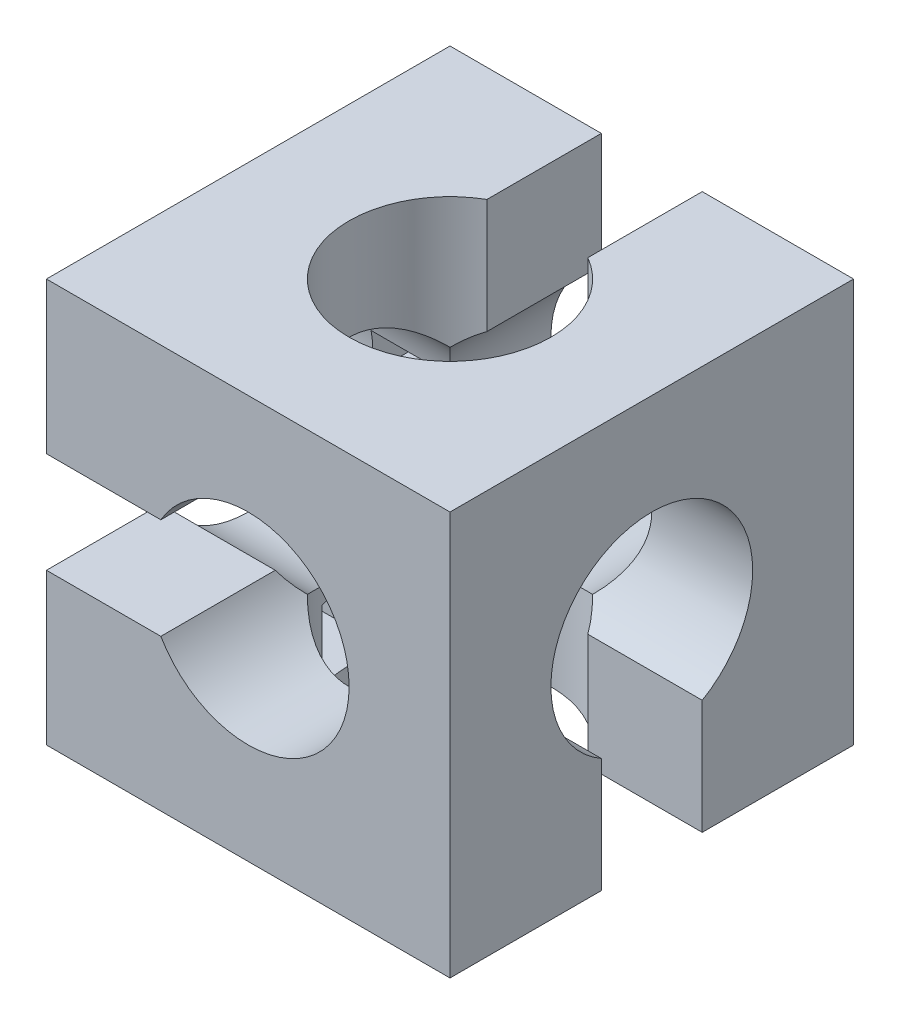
ISO-10303-21;
HEADER;
FILE_DESCRIPTION(('STEP AP214'),'2;1');
FILE_NAME('part.step','',(''),(''),'','','');
FILE_SCHEMA(('AUTOMOTIVE_DESIGN { 1 0 10303 214 1 1 1 1 }'));
ENDSEC;
DATA;
#1=APPLICATION_CONTEXT('core data for automotive mechanical design processes');
#2=APPLICATION_PROTOCOL_DEFINITION('international standard','automotive_design',2000,#1);
#3=PRODUCT_CONTEXT('',#1,'mechanical');
#4=PRODUCT('Part','Part','',(#3));
#5=PRODUCT_RELATED_PRODUCT_CATEGORY('part','',(#4));
#6=PRODUCT_DEFINITION_FORMATION('','',#4);
#7=PRODUCT_DEFINITION_CONTEXT('part definition',#1,'design');
#8=PRODUCT_DEFINITION('design','',#6,#7);
#9=PRODUCT_DEFINITION_SHAPE('','',#8);
#10=(LENGTH_UNIT() NAMED_UNIT(*) SI_UNIT(.MILLI.,.METRE.));
#11=(NAMED_UNIT(*) PLANE_ANGLE_UNIT() SI_UNIT($,.RADIAN.));
#12=(NAMED_UNIT(*) SI_UNIT($,.STERADIAN.) SOLID_ANGLE_UNIT());
#13=UNCERTAINTY_MEASURE_WITH_UNIT(LENGTH_MEASURE(1.E-05),#10,'distance_accuracy_value','');
#14=(GEOMETRIC_REPRESENTATION_CONTEXT(3) GLOBAL_UNCERTAINTY_ASSIGNED_CONTEXT((#13)) GLOBAL_UNIT_ASSIGNED_CONTEXT((#10,
#11,#12)) REPRESENTATION_CONTEXT('',''));
#15=CARTESIAN_POINT('',(0.,0.,0.));
#16=DIRECTION('',(0.,0.,1.));
#17=DIRECTION('',(1.,0.,0.));
#18=AXIS2_PLACEMENT_3D('',#15,#16,#17);
#19=CARTESIAN_POINT('',(0.,0.,-0.001000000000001));
#20=DIRECTION('',(0.,0.,1.));
#21=DIRECTION('',(1.,0.,0.));
#22=AXIS2_PLACEMENT_3D('',#19,#20,#21);
#23=CYLINDRICAL_SURFACE('',#22,10.);
#24=DIRECTION('',(0.,0.,1.));
#25=VECTOR('',#24,1.);
#26=CARTESIAN_POINT('',(9.78346509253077,2.0697368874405,-0.001000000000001));
#27=LINE('',#26,#25);
#28=CARTESIAN_POINT('',(9.78346509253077,2.0697368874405,32.2283469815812));
#29=VERTEX_POINT('',#28);
#30=CARTESIAN_POINT('',(9.78346509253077,2.0697368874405,37.3911185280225));
#31=VERTEX_POINT('',#30);
#32=EDGE_CURVE('E519',#29,#31,#27,.T.);
#33=ORIENTED_EDGE('',*,*,#32,.T.);
#34=CARTESIAN_POINT('',(0.,0.,37.3911185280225));
#35=DIRECTION('',(0.,0.,1.));
#36=DIRECTION('',(1.,0.,0.));
#37=AXIS2_PLACEMENT_3D('',#34,#35,#36);
#38=CIRCLE('',#37,10.);
#39=CARTESIAN_POINT('',(9.78346509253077,-2.0697368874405,37.3911185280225));
#40=VERTEX_POINT('',#39);
#41=EDGE_CURVE('E528',#31,#40,#38,.F.);
#42=ORIENTED_EDGE('',*,*,#41,.T.);
#43=DIRECTION('',(0.,0.,1.));
#44=VECTOR('',#43,1.);
#45=CARTESIAN_POINT('',(9.78346509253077,-2.0697368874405,-0.001000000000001));
#46=LINE('',#45,#44);
#47=CARTESIAN_POINT('',(9.78346509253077,-2.0697368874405,32.2283469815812));
#48=VERTEX_POINT('',#47);
#49=EDGE_CURVE('E525',#40,#48,#46,.F.);
#50=ORIENTED_EDGE('',*,*,#49,.T.);
#51=CARTESIAN_POINT('',(0.,0.,32.2283469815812));
#52=DIRECTION('',(0.,0.,-1.));
#53=DIRECTION('',(-1.,0.,0.));
#54=AXIS2_PLACEMENT_3D('',#51,#52,#53);
#55=CIRCLE('',#54,10.);
#56=EDGE_CURVE('E522',#48,#29,#55,.F.);
#57=ORIENTED_EDGE('',*,*,#56,.T.);
#58=EDGE_LOOP('',(#33,#42,#50,#57));
#59=FACE_BOUND('',#58,.T.);
#60=CARTESIAN_POINT('',(0.,0.,20.));
#61=DIRECTION('',(0.707106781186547,0.,0.707106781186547));
#62=DIRECTION('',(-0.707106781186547,0.,0.707106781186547));
#63=AXIS2_PLACEMENT_3D('',#60,#61,#62);
#64=ELLIPSE('',#63,14.1421356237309,10.);
#65=CARTESIAN_POINT('',(-7.07106781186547,-7.07106781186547,27.0710678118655));
#66=VERTEX_POINT('',#65);
#67=CARTESIAN_POINT('',(-8.66025403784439,-5.,28.6602540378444));
#68=VERTEX_POINT('',#67);
#69=EDGE_CURVE('E482',#66,#68,#64,.F.);
#70=ORIENTED_EDGE('',*,*,#69,.T.);
#71=DIRECTION('',(0.,0.,1.));
#72=VECTOR('',#71,1.);
#73=CARTESIAN_POINT('',(-8.66025403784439,-5.,-0.001000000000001));
#74=LINE('',#73,#72);
#75=CARTESIAN_POINT('',(-8.66025403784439,-5.,40.));
#76=VERTEX_POINT('',#75);
#77=EDGE_CURVE('E375',#68,#76,#74,.T.);
#78=ORIENTED_EDGE('',*,*,#77,.T.);
#79=CARTESIAN_POINT('',(0.,0.,40.));
#80=DIRECTION('',(0.,0.,1.));
#81=DIRECTION('',(1.,0.,0.));
#82=AXIS2_PLACEMENT_3D('',#79,#80,#81);
#83=CIRCLE('',#82,10.);
#84=CARTESIAN_POINT('',(-8.66025403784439,5.,40.));
#85=VERTEX_POINT('',#84);
#86=EDGE_CURVE('E440',#76,#85,#83,.T.);
#87=ORIENTED_EDGE('',*,*,#86,.T.);
#88=DIRECTION('',(0.,0.,1.));
#89=VECTOR('',#88,1.);
#90=CARTESIAN_POINT('',(-8.66025403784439,5.,-0.001000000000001));
#91=LINE('',#90,#89);
#92=CARTESIAN_POINT('',(-8.66025403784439,5.,28.6602540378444));
#93=VERTEX_POINT('',#92);
#94=EDGE_CURVE('E369',#85,#93,#91,.F.);
#95=ORIENTED_EDGE('',*,*,#94,.T.);
#96=CARTESIAN_POINT('',(-7.07106781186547,7.07106781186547,27.0710678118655));
#97=VERTEX_POINT('',#96);
#98=EDGE_CURVE('E481',#93,#97,#64,.F.);
#99=ORIENTED_EDGE('',*,*,#98,.T.);
#100=CARTESIAN_POINT('',(0.,0.,20.));
#101=DIRECTION('',(0.,-0.707106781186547,0.707106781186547));
#102=DIRECTION('',(0.,0.707106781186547,0.707106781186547));
#103=AXIS2_PLACEMENT_3D('',#100,#101,#102);
#104=ELLIPSE('',#103,14.142135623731,10.);
#105=CARTESIAN_POINT('',(7.07106781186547,7.07106781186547,27.0710678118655));
#106=VERTEX_POINT('',#105);
#107=EDGE_CURVE('E427',#97,#106,#104,.F.);
#108=ORIENTED_EDGE('',*,*,#107,.T.);
#109=CARTESIAN_POINT('',(0.,0.,20.));
#110=DIRECTION('',(-0.707106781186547,0.,0.707106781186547));
#111=DIRECTION('',(0.707106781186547,0.,0.707106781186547));
#112=AXIS2_PLACEMENT_3D('',#109,#110,#111);
#113=ELLIPSE('',#112,14.1421356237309,10.);
#114=CARTESIAN_POINT('',(7.07106781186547,-7.07106781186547,27.0710678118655));
#115=VERTEX_POINT('',#114);
#116=EDGE_CURVE('E491',#106,#115,#113,.F.);
#117=ORIENTED_EDGE('',*,*,#116,.T.);
#118=CARTESIAN_POINT('',(0.,0.,20.));
#119=DIRECTION('',(0.,0.707106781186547,0.707106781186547));
#120=DIRECTION('',(0.,-0.707106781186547,0.707106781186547));
#121=AXIS2_PLACEMENT_3D('',#118,#119,#120);
#122=ELLIPSE('',#121,14.142135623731,10.);
#123=EDGE_CURVE('E417',#115,#66,#122,.F.);
#124=ORIENTED_EDGE('',*,*,#123,.T.);
#125=EDGE_LOOP('',(#70,#78,#87,#95,#99,#108,#117,#124));
#126=FACE_BOUND('',#125,.T.);
#127=ADVANCED_FACE('F32',(#59,#126),#23,.F.);
#128=CARTESIAN_POINT('',(20.,-20.,40.));
#129=DIRECTION('',(-1.,0.,0.));
#130=DIRECTION('',(0.,0.,1.));
#131=AXIS2_PLACEMENT_3D('',#128,#129,#130);
#132=PLANE('',#131);
#133=CARTESIAN_POINT('',(20.,0.,20.));
#134=DIRECTION('',(-1.,0.,0.));
#135=DIRECTION('',(0.,0.,1.));
#136=AXIS2_PLACEMENT_3D('',#133,#134,#135);
#137=CIRCLE('',#136,10.);
#138=CARTESIAN_POINT('',(20.,-8.66025403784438,25.));
#139=VERTEX_POINT('',#138);
#140=CARTESIAN_POINT('',(20.,-8.66025403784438,15.));
#141=VERTEX_POINT('',#140);
#142=EDGE_CURVE('E434',#139,#141,#137,.T.);
#143=ORIENTED_EDGE('',*,*,#142,.T.);
#144=DIRECTION('',(0.,1.,0.));
#145=VECTOR('',#144,1.);
#146=CARTESIAN_POINT('',(20.,-34.835711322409,15.));
#147=LINE('',#146,#145);
#148=CARTESIAN_POINT('',(20.,-20.,15.));
#149=VERTEX_POINT('',#148);
#150=EDGE_CURVE('E378',#149,#141,#147,.T.);
#151=ORIENTED_EDGE('',*,*,#150,.F.);
#152=DIRECTION('',(0.,0.,-1.));
#153=VECTOR('',#152,1.);
#154=CARTESIAN_POINT('',(20.,-20.,40.));
#155=LINE('',#154,#153);
#156=CARTESIAN_POINT('',(20.,-20.,0.));
#157=VERTEX_POINT('',#156);
#158=EDGE_CURVE('E458',#149,#157,#155,.T.);
#159=ORIENTED_EDGE('',*,*,#158,.T.);
#160=DIRECTION('',(0.,1.,0.));
#161=VECTOR('',#160,1.);
#162=CARTESIAN_POINT('',(20.,-20.,0.));
#163=LINE('',#162,#161);
#164=CARTESIAN_POINT('',(20.,20.,0.));
#165=VERTEX_POINT('',#164);
#166=EDGE_CURVE('E443',#157,#165,#163,.T.);
#167=ORIENTED_EDGE('',*,*,#166,.T.);
#168=DIRECTION('',(0.,0.,-1.));
#169=VECTOR('',#168,1.);
#170=CARTESIAN_POINT('',(20.,20.,40.));
#171=LINE('',#170,#169);
#172=CARTESIAN_POINT('',(20.,20.,40.));
#173=VERTEX_POINT('',#172);
#174=EDGE_CURVE('E478',#173,#165,#171,.T.);
#175=ORIENTED_EDGE('',*,*,#174,.F.);
#176=DIRECTION('',(0.,1.,0.));
#177=VECTOR('',#176,1.);
#178=CARTESIAN_POINT('',(20.,-20.,40.));
#179=LINE('',#178,#177);
#180=CARTESIAN_POINT('',(20.,-20.,40.));
#181=VERTEX_POINT('',#180);
#182=EDGE_CURVE('E446',#181,#173,#179,.T.);
#183=ORIENTED_EDGE('',*,*,#182,.F.);
#184=CARTESIAN_POINT('',(20.,-20.,25.));
#185=VERTEX_POINT('',#184);
#186=EDGE_CURVE('E469',#181,#185,#155,.T.);
#187=ORIENTED_EDGE('',*,*,#186,.T.);
#188=DIRECTION('',(0.,-1.,0.));
#189=VECTOR('',#188,1.);
#190=CARTESIAN_POINT('',(20.,-34.835711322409,25.));
#191=LINE('',#190,#189);
#192=EDGE_CURVE('E380',#139,#185,#191,.T.);
#193=ORIENTED_EDGE('',*,*,#192,.F.);
#194=EDGE_LOOP('',(#143,#151,#159,#167,#175,#183,#187,#193));
#195=FACE_BOUND('',#194,.T.);
#196=ADVANCED_FACE('F34',(#195),#132,.F.);
#197=CARTESIAN_POINT('',(-20.,20.,40.));
#198=DIRECTION('',(0.,-1.,0.));
#199=DIRECTION('',(0.,0.,-1.));
#200=AXIS2_PLACEMENT_3D('',#197,#198,#199);
#201=PLANE('',#200);
#202=DIRECTION('',(-1.,0.,0.));
#203=VECTOR('',#202,1.);
#204=CARTESIAN_POINT('',(-20.,20.,0.));
#205=LINE('',#204,#203);
#206=CARTESIAN_POINT('',(5.,20.,0.));
#207=VERTEX_POINT('',#206);
#208=EDGE_CURVE('E462',#165,#207,#205,.T.);
#209=ORIENTED_EDGE('',*,*,#208,.T.);
#210=DIRECTION('',(0.,0.,-1.));
#211=VECTOR('',#210,1.);
#212=CARTESIAN_POINT('',(5.,20.,-13.9180594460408));
#213=LINE('',#212,#211);
#214=CARTESIAN_POINT('',(5.,20.,11.3397459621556));
#215=VERTEX_POINT('',#214);
#216=EDGE_CURVE('E394',#215,#207,#213,.T.);
#217=ORIENTED_EDGE('',*,*,#216,.F.);
#218=CARTESIAN_POINT('',(0.,20.,20.));
#219=DIRECTION('',(0.,1.,0.));
#220=DIRECTION('',(0.,0.,1.));
#221=AXIS2_PLACEMENT_3D('',#218,#219,#220);
#222=CIRCLE('',#221,10.);
#223=CARTESIAN_POINT('',(-5.,20.,11.3397459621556));
#224=VERTEX_POINT('',#223);
#225=EDGE_CURVE('E408',#224,#215,#222,.T.);
#226=ORIENTED_EDGE('',*,*,#225,.F.);
#227=DIRECTION('',(0.,0.,1.));
#228=VECTOR('',#227,1.);
#229=CARTESIAN_POINT('',(-5.,20.,-13.9180594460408));
#230=LINE('',#229,#228);
#231=CARTESIAN_POINT('',(-5.,20.,0.));
#232=VERTEX_POINT('',#231);
#233=EDGE_CURVE('E396',#232,#224,#230,.T.);
#234=ORIENTED_EDGE('',*,*,#233,.F.);
#235=CARTESIAN_POINT('',(-20.,20.,0.));
#236=VERTEX_POINT('',#235);
#237=EDGE_CURVE('E461',#232,#236,#205,.T.);
#238=ORIENTED_EDGE('',*,*,#237,.T.);
#239=DIRECTION('',(0.,0.,-1.));
#240=VECTOR('',#239,1.);
#241=CARTESIAN_POINT('',(-20.,20.,40.));
#242=LINE('',#241,#240);
#243=CARTESIAN_POINT('',(-20.,20.,40.));
#244=VERTEX_POINT('',#243);
#245=EDGE_CURVE('E475',#244,#236,#242,.T.);
#246=ORIENTED_EDGE('',*,*,#245,.F.);
#247=DIRECTION('',(-1.,0.,0.));
#248=VECTOR('',#247,1.);
#249=CARTESIAN_POINT('',(-20.,20.,40.));
#250=LINE('',#249,#248);
#251=EDGE_CURVE('E449',#173,#244,#250,.T.);
#252=ORIENTED_EDGE('',*,*,#251,.F.);
#253=ORIENTED_EDGE('',*,*,#174,.T.);
#254=EDGE_LOOP('',(#209,#217,#226,#234,#238,#246,#252,#253));
#255=FACE_BOUND('',#254,.T.);
#256=ADVANCED_FACE('F584',(#255),#201,.F.);
#257=CARTESIAN_POINT('',(-20.,-20.,40.));
#258=DIRECTION('',(1.,0.,0.));
#259=DIRECTION('',(0.,0.,-1.));
#260=AXIS2_PLACEMENT_3D('',#257,#258,#259);
#261=PLANE('',#260);
#262=DIRECTION('',(0.,-1.,0.));
#263=VECTOR('',#262,1.);
#264=CARTESIAN_POINT('',(-20.,-20.,40.));
#265=LINE('',#264,#263);
#266=CARTESIAN_POINT('',(-20.,-5.,40.));
#267=VERTEX_POINT('',#266);
#268=CARTESIAN_POINT('',(-20.,-20.,40.));
#269=VERTEX_POINT('',#268);
#270=EDGE_CURVE('E452',#267,#269,#265,.T.);
#271=ORIENTED_EDGE('',*,*,#270,.F.);
#272=DIRECTION('',(0.,0.,-1.));
#273=VECTOR('',#272,1.);
#274=CARTESIAN_POINT('',(-20.,-5.,40.));
#275=LINE('',#274,#273);
#276=CARTESIAN_POINT('',(-20.,-5.,28.6602540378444));
#277=VERTEX_POINT('',#276);
#278=EDGE_CURVE('E372',#267,#277,#275,.T.);
#279=ORIENTED_EDGE('',*,*,#278,.T.);
#280=CARTESIAN_POINT('',(-20.,0.,20.));
#281=DIRECTION('',(-1.,0.,0.));
#282=DIRECTION('',(0.,0.,1.));
#283=AXIS2_PLACEMENT_3D('',#280,#281,#282);
#284=CIRCLE('',#283,10.);
#285=CARTESIAN_POINT('',(-20.,5.,28.6602540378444));
#286=VERTEX_POINT('',#285);
#287=EDGE_CURVE('E433',#286,#277,#284,.T.);
#288=ORIENTED_EDGE('',*,*,#287,.F.);
#289=DIRECTION('',(0.,0.,1.));
#290=VECTOR('',#289,1.);
#291=CARTESIAN_POINT('',(-20.,5.,40.));
#292=LINE('',#291,#290);
#293=CARTESIAN_POINT('',(-20.,5.,40.));
#294=VERTEX_POINT('',#293);
#295=EDGE_CURVE('E366',#286,#294,#292,.T.);
#296=ORIENTED_EDGE('',*,*,#295,.T.);
#297=EDGE_CURVE('E453',#244,#294,#265,.T.);
#298=ORIENTED_EDGE('',*,*,#297,.F.);
#299=ORIENTED_EDGE('',*,*,#245,.T.);
#300=DIRECTION('',(0.,-1.,0.));
#301=VECTOR('',#300,1.);
#302=CARTESIAN_POINT('',(-20.,-20.,0.));
#303=LINE('',#302,#301);
#304=CARTESIAN_POINT('',(-20.,-20.,0.));
#305=VERTEX_POINT('',#304);
#306=EDGE_CURVE('E465',#236,#305,#303,.T.);
#307=ORIENTED_EDGE('',*,*,#306,.T.);
#308=DIRECTION('',(0.,0.,-1.));
#309=VECTOR('',#308,1.);
#310=CARTESIAN_POINT('',(-20.,-20.,40.));
#311=LINE('',#310,#309);
#312=EDGE_CURVE('E472',#269,#305,#311,.T.);
#313=ORIENTED_EDGE('',*,*,#312,.F.);
#314=EDGE_LOOP('',(#271,#279,#288,#296,#298,#299,#307,#313));
#315=FACE_BOUND('',#314,.T.);
#316=ADVANCED_FACE('F853',(#315),#261,.F.);
#317=CARTESIAN_POINT('',(-20.,-20.,40.));
#318=DIRECTION('',(0.,1.,0.));
#319=DIRECTION('',(0.,0.,1.));
#320=AXIS2_PLACEMENT_3D('',#317,#318,#319);
#321=PLANE('',#320);
#322=ORIENTED_EDGE('',*,*,#158,.F.);
#323=DIRECTION('',(-1.,0.,0.));
#324=VECTOR('',#323,1.);
#325=CARTESIAN_POINT('',(-20.,-20.,15.));
#326=LINE('',#325,#324);
#327=CARTESIAN_POINT('',(8.66025403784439,-20.,15.));
#328=VERTEX_POINT('',#327);
#329=EDGE_CURVE('E391',#149,#328,#326,.T.);
#330=ORIENTED_EDGE('',*,*,#329,.T.);
#331=CARTESIAN_POINT('',(0.,-20.,20.));
#332=DIRECTION('',(0.,1.,0.));
#333=DIRECTION('',(0.,0.,1.));
#334=AXIS2_PLACEMENT_3D('',#331,#332,#333);
#335=CIRCLE('',#334,10.);
#336=CARTESIAN_POINT('',(8.66025403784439,-20.,25.));
#337=VERTEX_POINT('',#336);
#338=EDGE_CURVE('E409',#328,#337,#335,.T.);
#339=ORIENTED_EDGE('',*,*,#338,.T.);
#340=DIRECTION('',(1.,0.,0.));
#341=VECTOR('',#340,1.);
#342=CARTESIAN_POINT('',(-20.,-20.,25.));
#343=LINE('',#342,#341);
#344=EDGE_CURVE('E385',#337,#185,#343,.T.);
#345=ORIENTED_EDGE('',*,*,#344,.T.);
#346=ORIENTED_EDGE('',*,*,#186,.F.);
#347=DIRECTION('',(1.,0.,0.));
#348=VECTOR('',#347,1.);
#349=CARTESIAN_POINT('',(-20.,-20.,40.));
#350=LINE('',#349,#348);
#351=EDGE_CURVE('E456',#269,#181,#350,.T.);
#352=ORIENTED_EDGE('',*,*,#351,.F.);
#353=ORIENTED_EDGE('',*,*,#312,.T.);
#354=DIRECTION('',(1.,0.,0.));
#355=VECTOR('',#354,1.);
#356=CARTESIAN_POINT('',(-20.,-20.,0.));
#357=LINE('',#356,#355);
#358=EDGE_CURVE('E450',#305,#157,#357,.T.);
#359=ORIENTED_EDGE('',*,*,#358,.T.);
#360=EDGE_LOOP('',(#322,#330,#339,#345,#346,#352,#353,#359));
#361=FACE_BOUND('',#360,.T.);
#362=ADVANCED_FACE('F849',(#361),#321,.F.);
#363=CARTESIAN_POINT('',(0.,0.,40.));
#364=DIRECTION('',(0.,0.,-1.));
#365=DIRECTION('',(-1.,0.,0.));
#366=AXIS2_PLACEMENT_3D('',#363,#364,#365);
#367=PLANE('',#366);
#368=ORIENTED_EDGE('',*,*,#86,.F.);
#369=DIRECTION('',(1.,0.,0.));
#370=VECTOR('',#369,1.);
#371=CARTESIAN_POINT('',(-35.8559429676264,-5.,40.));
#372=LINE('',#371,#370);
#373=EDGE_CURVE('E364',#267,#76,#372,.T.);
#374=ORIENTED_EDGE('',*,*,#373,.F.);
#375=ORIENTED_EDGE('',*,*,#270,.T.);
#376=ORIENTED_EDGE('',*,*,#351,.T.);
#377=ORIENTED_EDGE('',*,*,#182,.T.);
#378=ORIENTED_EDGE('',*,*,#251,.T.);
#379=ORIENTED_EDGE('',*,*,#297,.T.);
#380=DIRECTION('',(-1.,0.,0.));
#381=VECTOR('',#380,1.);
#382=CARTESIAN_POINT('',(-35.8559429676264,5.,40.));
#383=LINE('',#382,#381);
#384=EDGE_CURVE('E355',#85,#294,#383,.T.);
#385=ORIENTED_EDGE('',*,*,#384,.F.);
#386=EDGE_LOOP('',(#368,#374,#375,#376,#377,#378,#379,#385));
#387=FACE_BOUND('',#386,.T.);
#388=ADVANCED_FACE('F600',(#387),#367,.F.);
#389=CARTESIAN_POINT('',(0.,0.,0.));
#390=DIRECTION('',(0.,0.,-1.));
#391=DIRECTION('',(-1.,0.,0.));
#392=AXIS2_PLACEMENT_3D('',#389,#390,#391);
#393=PLANE('',#392);
#394=DIRECTION('',(0.,-1.,0.));
#395=VECTOR('',#394,1.);
#396=CARTESIAN_POINT('',(5.,0.,0.));
#397=LINE('',#396,#395);
#398=CARTESIAN_POINT('',(5.,8.66025403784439,0.));
#399=VERTEX_POINT('',#398);
#400=EDGE_CURVE('E406',#207,#399,#397,.T.);
#401=ORIENTED_EDGE('',*,*,#400,.F.);
#402=ORIENTED_EDGE('',*,*,#208,.F.);
#403=ORIENTED_EDGE('',*,*,#166,.F.);
#404=ORIENTED_EDGE('',*,*,#358,.F.);
#405=ORIENTED_EDGE('',*,*,#306,.F.);
#406=ORIENTED_EDGE('',*,*,#237,.F.);
#407=DIRECTION('',(0.,1.,0.));
#408=VECTOR('',#407,1.);
#409=CARTESIAN_POINT('',(-5.,0.,0.));
#410=LINE('',#409,#408);
#411=CARTESIAN_POINT('',(-5.,8.66025403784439,0.));
#412=VERTEX_POINT('',#411);
#413=EDGE_CURVE('E401',#412,#232,#410,.T.);
#414=ORIENTED_EDGE('',*,*,#413,.F.);
#415=CARTESIAN_POINT('',(0.,0.,0.));
#416=DIRECTION('',(0.,0.,-1.));
#417=DIRECTION('',(-1.,0.,0.));
#418=AXIS2_PLACEMENT_3D('',#415,#416,#417);
#419=CIRCLE('',#418,10.);
#420=EDGE_CURVE('E437',#412,#399,#419,.F.);
#421=ORIENTED_EDGE('',*,*,#420,.T.);
#422=EDGE_LOOP('',(#401,#402,#403,#404,#405,#406,#414,#421));
#423=FACE_BOUND('',#422,.T.);
#424=ADVANCED_FACE('F591',(#423),#393,.T.);
#425=CARTESIAN_POINT('',(0.,0.,20.));
#426=DIRECTION('',(0.,0.707106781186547,0.707106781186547));
#427=DIRECTION('',(0.,-0.707106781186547,0.707106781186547));
#428=AXIS2_PLACEMENT_3D('',#425,#426,#427);
#429=ELLIPSE('',#428,14.142135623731,10.);
#430=CARTESIAN_POINT('',(7.07106781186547,7.07106781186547,12.9289321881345));
#431=VERTEX_POINT('',#430);
#432=CARTESIAN_POINT('',(5.,8.66025403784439,11.3397459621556));
#433=VERTEX_POINT('',#432);
#434=EDGE_CURVE('E424',#431,#433,#429,.T.);
#435=ORIENTED_EDGE('',*,*,#434,.T.);
#436=DIRECTION('',(0.,0.,1.));
#437=VECTOR('',#436,1.);
#438=CARTESIAN_POINT('',(5.,8.66025403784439,-0.00100000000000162));
#439=LINE('',#438,#437);
#440=EDGE_CURVE('E403',#433,#399,#439,.F.);
#441=ORIENTED_EDGE('',*,*,#440,.T.);
#442=ORIENTED_EDGE('',*,*,#420,.F.);
#443=DIRECTION('',(0.,0.,1.));
#444=VECTOR('',#443,1.);
#445=CARTESIAN_POINT('',(-5.,8.66025403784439,-0.00100000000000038));
#446=LINE('',#445,#444);
#447=CARTESIAN_POINT('',(-5.,8.66025403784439,11.3397459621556));
#448=VERTEX_POINT('',#447);
#449=EDGE_CURVE('E398',#412,#448,#446,.T.);
#450=ORIENTED_EDGE('',*,*,#449,.T.);
#451=CARTESIAN_POINT('',(-7.07106781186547,7.07106781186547,12.9289321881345));
#452=VERTEX_POINT('',#451);
#453=EDGE_CURVE('E423',#448,#452,#429,.T.);
#454=ORIENTED_EDGE('',*,*,#453,.T.);
#455=CARTESIAN_POINT('',(0.,0.,20.));
#456=DIRECTION('',(-0.707106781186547,0.,0.707106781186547));
#457=DIRECTION('',(0.707106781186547,0.,0.707106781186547));
#458=AXIS2_PLACEMENT_3D('',#455,#456,#457);
#459=ELLIPSE('',#458,14.1421356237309,10.);
#460=CARTESIAN_POINT('',(-7.07106781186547,-7.07106781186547,12.9289321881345));
#461=VERTEX_POINT('',#460);
#462=EDGE_CURVE('E488',#452,#461,#459,.T.);
#463=ORIENTED_EDGE('',*,*,#462,.T.);
#464=CARTESIAN_POINT('',(0.,0.,20.));
#465=DIRECTION('',(0.,-0.707106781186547,0.707106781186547));
#466=DIRECTION('',(0.,0.707106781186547,0.707106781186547));
#467=AXIS2_PLACEMENT_3D('',#464,#465,#466);
#468=ELLIPSE('',#467,14.142135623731,10.);
#469=CARTESIAN_POINT('',(7.07106781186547,-7.07106781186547,12.9289321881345));
#470=VERTEX_POINT('',#469);
#471=EDGE_CURVE('E412',#461,#470,#468,.T.);
#472=ORIENTED_EDGE('',*,*,#471,.T.);
#473=CARTESIAN_POINT('',(0.,0.,20.));
#474=DIRECTION('',(0.707106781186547,0.,0.707106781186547));
#475=DIRECTION('',(-0.707106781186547,0.,0.707106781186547));
#476=AXIS2_PLACEMENT_3D('',#473,#474,#475);
#477=ELLIPSE('',#476,14.1421356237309,10.);
#478=EDGE_CURVE('E485',#470,#431,#477,.T.);
#479=ORIENTED_EDGE('',*,*,#478,.T.);
#480=EDGE_LOOP('',(#435,#441,#442,#450,#454,#463,#472,#479));
#481=FACE_BOUND('',#480,.T.);
#482=ADVANCED_FACE('F578',(#481),#23,.F.);
#483=CARTESIAN_POINT('',(20.,0.,20.));
#484=DIRECTION('',(-1.,0.,0.));
#485=DIRECTION('',(0.,0.,1.));
#486=AXIS2_PLACEMENT_3D('',#483,#484,#485);
#487=CYLINDRICAL_SURFACE('',#486,10.);
#488=DIRECTION('',(-1.,0.,0.));
#489=VECTOR('',#488,1.);
#490=CARTESIAN_POINT('',(20.,1.84537897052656,10.1717460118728));
#491=LINE('',#490,#489);
#492=CARTESIAN_POINT('',(-17.6520071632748,1.84537897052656,10.1717460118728));
#493=VERTEX_POINT('',#492);
#494=CARTESIAN_POINT('',(-12.5298892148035,1.84537897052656,10.1717460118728));
#495=VERTEX_POINT('',#494);
#496=EDGE_CURVE('E531',#493,#495,#491,.F.);
#497=ORIENTED_EDGE('',*,*,#496,.T.);
#498=CARTESIAN_POINT('',(-12.5298892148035,0.,20.));
#499=DIRECTION('',(1.,0.,0.));
#500=DIRECTION('',(0.,0.,-1.));
#501=AXIS2_PLACEMENT_3D('',#498,#499,#500);
#502=CIRCLE('',#501,10.);
#503=CARTESIAN_POINT('',(-12.5298892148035,-1.84537897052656,10.1717460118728));
#504=VERTEX_POINT('',#503);
#505=EDGE_CURVE('E540',#495,#504,#502,.F.);
#506=ORIENTED_EDGE('',*,*,#505,.T.);
#507=DIRECTION('',(-1.,0.,0.));
#508=VECTOR('',#507,1.);
#509=CARTESIAN_POINT('',(20.,-1.84537897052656,10.1717460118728));
#510=LINE('',#509,#508);
#511=CARTESIAN_POINT('',(-17.6520071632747,-1.84537897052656,10.1717460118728));
#512=VERTEX_POINT('',#511);
#513=EDGE_CURVE('E537',#504,#512,#510,.T.);
#514=ORIENTED_EDGE('',*,*,#513,.T.);
#515=CARTESIAN_POINT('',(-17.6520071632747,0.,20.));
#516=DIRECTION('',(-1.,0.,0.));
#517=DIRECTION('',(0.,0.,1.));
#518=AXIS2_PLACEMENT_3D('',#515,#516,#517);
#519=CIRCLE('',#518,10.);
#520=EDGE_CURVE('E534',#512,#493,#519,.F.);
#521=ORIENTED_EDGE('',*,*,#520,.T.);
#522=EDGE_LOOP('',(#497,#506,#514,#521));
#523=FACE_BOUND('',#522,.T.);
#524=ORIENTED_EDGE('',*,*,#287,.T.);
#525=DIRECTION('',(-1.,0.,0.));
#526=VECTOR('',#525,1.);
#527=CARTESIAN_POINT('',(20.,-5.,28.6602540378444));
#528=LINE('',#527,#526);
#529=EDGE_CURVE('E516',#277,#68,#528,.F.);
#530=ORIENTED_EDGE('',*,*,#529,.T.);
#531=ORIENTED_EDGE('',*,*,#69,.F.);
#532=CARTESIAN_POINT('',(0.,0.,20.));
#533=DIRECTION('',(-0.707106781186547,0.707106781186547,0.));
#534=DIRECTION('',(-0.707106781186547,-0.707106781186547,0.));
#535=AXIS2_PLACEMENT_3D('',#532,#533,#534);
#536=ELLIPSE('',#535,14.1421356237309,10.);
#537=EDGE_CURVE('E420',#66,#461,#536,.F.);
#538=ORIENTED_EDGE('',*,*,#537,.T.);
#539=ORIENTED_EDGE('',*,*,#462,.F.);
#540=CARTESIAN_POINT('',(0.,0.,20.));
#541=DIRECTION('',(-0.707106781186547,-0.707106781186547,0.));
#542=DIRECTION('',(-0.707106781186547,0.707106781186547,0.));
#543=AXIS2_PLACEMENT_3D('',#540,#541,#542);
#544=ELLIPSE('',#543,14.1421356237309,10.);
#545=EDGE_CURVE('E430',#452,#97,#544,.F.);
#546=ORIENTED_EDGE('',*,*,#545,.T.);
#547=ORIENTED_EDGE('',*,*,#98,.F.);
#548=DIRECTION('',(-1.,0.,0.));
#549=VECTOR('',#548,1.);
#550=CARTESIAN_POINT('',(20.,5.,28.6602540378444));
#551=LINE('',#550,#549);
#552=EDGE_CURVE('E513',#93,#286,#551,.T.);
#553=ORIENTED_EDGE('',*,*,#552,.T.);
#554=EDGE_LOOP('',(#524,#530,#531,#538,#539,#546,#547,#553));
#555=FACE_BOUND('',#554,.T.);
#556=ADVANCED_FACE('F590',(#523,#555),#487,.F.);
#557=CARTESIAN_POINT('',(0.,0.,20.));
#558=DIRECTION('',(-0.707106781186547,-0.707106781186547,0.));
#559=DIRECTION('',(-0.707106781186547,0.707106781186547,0.));
#560=AXIS2_PLACEMENT_3D('',#557,#558,#559);
#561=ELLIPSE('',#560,14.1421356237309,10.);
#562=CARTESIAN_POINT('',(8.66025403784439,-8.66025403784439,15.));
#563=VERTEX_POINT('',#562);
#564=EDGE_CURVE('E495',#470,#563,#561,.T.);
#565=ORIENTED_EDGE('',*,*,#564,.T.);
#566=DIRECTION('',(-1.,0.,0.));
#567=VECTOR('',#566,1.);
#568=CARTESIAN_POINT('',(20.,-8.66025403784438,15.));
#569=LINE('',#568,#567);
#570=EDGE_CURVE('E388',#563,#141,#569,.F.);
#571=ORIENTED_EDGE('',*,*,#570,.T.);
#572=ORIENTED_EDGE('',*,*,#142,.F.);
#573=DIRECTION('',(-1.,0.,0.));
#574=VECTOR('',#573,1.);
#575=CARTESIAN_POINT('',(20.,-8.66025403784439,25.));
#576=LINE('',#575,#574);
#577=CARTESIAN_POINT('',(8.66025403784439,-8.66025403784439,25.));
#578=VERTEX_POINT('',#577);
#579=EDGE_CURVE('E382',#139,#578,#576,.T.);
#580=ORIENTED_EDGE('',*,*,#579,.T.);
#581=EDGE_CURVE('E494',#578,#115,#561,.T.);
#582=ORIENTED_EDGE('',*,*,#581,.T.);
#583=ORIENTED_EDGE('',*,*,#116,.F.);
#584=CARTESIAN_POINT('',(0.,0.,20.));
#585=DIRECTION('',(-0.707106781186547,0.707106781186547,0.));
#586=DIRECTION('',(-0.707106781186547,-0.707106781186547,0.));
#587=AXIS2_PLACEMENT_3D('',#584,#585,#586);
#588=ELLIPSE('',#587,14.1421356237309,10.);
#589=EDGE_CURVE('E498',#106,#431,#588,.T.);
#590=ORIENTED_EDGE('',*,*,#589,.T.);
#591=ORIENTED_EDGE('',*,*,#478,.F.);
#592=EDGE_LOOP('',(#565,#571,#572,#580,#582,#583,#590,#591));
#593=FACE_BOUND('',#592,.T.);
#594=ADVANCED_FACE('F598',(#593),#487,.F.);
#595=CARTESIAN_POINT('',(0.,-20.,20.));
#596=DIRECTION('',(0.,1.,0.));
#597=DIRECTION('',(0.,0.,1.));
#598=AXIS2_PLACEMENT_3D('',#595,#596,#597);
#599=CYLINDRICAL_SURFACE('',#598,10.);
#600=CARTESIAN_POINT('',(0.,-18.1696962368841,20.));
#601=DIRECTION('',(0.,-1.,0.));
#602=DIRECTION('',(0.,0.,-1.));
#603=AXIS2_PLACEMENT_3D('',#600,#601,#602);
#604=CIRCLE('',#603,10.);
#605=CARTESIAN_POINT('',(-9.43497292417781,-18.1696962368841,16.6861976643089));
#606=VERTEX_POINT('',#605);
#607=CARTESIAN_POINT('',(-9.46900713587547,-18.1696962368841,23.2152610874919));
#608=VERTEX_POINT('',#607);
#609=EDGE_CURVE('E555',#606,#608,#604,.F.);
#610=ORIENTED_EDGE('',*,*,#609,.T.);
#611=DIRECTION('',(0.,1.,0.));
#612=VECTOR('',#611,1.);
#613=CARTESIAN_POINT('',(-9.46900713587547,-20.,23.2152610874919));
#614=LINE('',#613,#612);
#615=CARTESIAN_POINT('',(-9.46900713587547,-11.1251804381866,23.2152610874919));
#616=VERTEX_POINT('',#615);
#617=EDGE_CURVE('E11',#608,#616,#614,.T.);
#618=ORIENTED_EDGE('',*,*,#617,.T.);
#619=CARTESIAN_POINT('',(0.,-11.1251804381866,20.));
#620=DIRECTION('',(0.,1.,0.));
#621=DIRECTION('',(0.,0.,1.));
#622=AXIS2_PLACEMENT_3D('',#619,#620,#621);
#623=CIRCLE('',#622,10.);
#624=CARTESIAN_POINT('',(-9.43497292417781,-11.1251804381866,16.6861976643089));
#625=VERTEX_POINT('',#624);
#626=EDGE_CURVE('E40',#616,#625,#623,.F.);
#627=ORIENTED_EDGE('',*,*,#626,.T.);
#628=DIRECTION('',(0.,1.,0.));
#629=VECTOR('',#628,1.);
#630=CARTESIAN_POINT('',(-9.43497292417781,-20.,16.6861976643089));
#631=LINE('',#630,#629);
#632=EDGE_CURVE('E557',#625,#606,#631,.F.);
#633=ORIENTED_EDGE('',*,*,#632,.T.);
#634=EDGE_LOOP('',(#610,#618,#627,#633));
#635=FACE_BOUND('',#634,.T.);
#636=ORIENTED_EDGE('',*,*,#338,.F.);
#637=DIRECTION('',(0.,1.,0.));
#638=VECTOR('',#637,1.);
#639=CARTESIAN_POINT('',(8.66025403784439,-20.,15.));
#640=LINE('',#639,#638);
#641=EDGE_CURVE('E510',#328,#563,#640,.T.);
#642=ORIENTED_EDGE('',*,*,#641,.T.);
#643=ORIENTED_EDGE('',*,*,#564,.F.);
#644=ORIENTED_EDGE('',*,*,#471,.F.);
#645=ORIENTED_EDGE('',*,*,#537,.F.);
#646=ORIENTED_EDGE('',*,*,#123,.F.);
#647=ORIENTED_EDGE('',*,*,#581,.F.);
#648=DIRECTION('',(0.,1.,0.));
#649=VECTOR('',#648,1.);
#650=CARTESIAN_POINT('',(8.66025403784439,-20.,25.));
#651=LINE('',#650,#649);
#652=EDGE_CURVE('E507',#578,#337,#651,.F.);
#653=ORIENTED_EDGE('',*,*,#652,.T.);
#654=EDGE_LOOP('',(#636,#642,#643,#644,#645,#646,#647,#653));
#655=FACE_BOUND('',#654,.T.);
#656=ADVANCED_FACE('F561',(#635,#655),#599,.F.);
#657=CARTESIAN_POINT('',(0.,17.5145329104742,20.));
#658=DIRECTION('',(0.,1.,0.));
#659=DIRECTION('',(0.,0.,1.));
#660=AXIS2_PLACEMENT_3D('',#657,#658,#659);
#661=CIRCLE('',#660,10.);
#662=CARTESIAN_POINT('',(1.45540137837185,17.5145329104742,29.8935234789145));
#663=VERTEX_POINT('',#662);
#664=CARTESIAN_POINT('',(-1.45540137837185,17.5145329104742,29.8935234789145));
#665=VERTEX_POINT('',#664);
#666=EDGE_CURVE('E543',#663,#665,#661,.F.);
#667=ORIENTED_EDGE('',*,*,#666,.T.);
#668=DIRECTION('',(0.,1.,0.));
#669=VECTOR('',#668,1.);
#670=CARTESIAN_POINT('',(-1.45540137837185,-20.,29.8935234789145));
#671=LINE('',#670,#669);
#672=CARTESIAN_POINT('',(-1.45540137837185,12.7514011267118,29.8935234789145));
#673=VERTEX_POINT('',#672);
#674=EDGE_CURVE('E552',#665,#673,#671,.F.);
#675=ORIENTED_EDGE('',*,*,#674,.T.);
#676=CARTESIAN_POINT('',(0.,12.7514011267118,20.));
#677=DIRECTION('',(0.,-1.,0.));
#678=DIRECTION('',(0.,0.,-1.));
#679=AXIS2_PLACEMENT_3D('',#676,#677,#678);
#680=CIRCLE('',#679,10.);
#681=CARTESIAN_POINT('',(1.45540137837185,12.7514011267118,29.8935234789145));
#682=VERTEX_POINT('',#681);
#683=EDGE_CURVE('E549',#673,#682,#680,.F.);
#684=ORIENTED_EDGE('',*,*,#683,.T.);
#685=DIRECTION('',(0.,1.,0.));
#686=VECTOR('',#685,1.);
#687=CARTESIAN_POINT('',(1.45540137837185,-20.,29.8935234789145));
#688=LINE('',#687,#686);
#689=EDGE_CURVE('E546',#682,#663,#688,.T.);
#690=ORIENTED_EDGE('',*,*,#689,.T.);
#691=EDGE_LOOP('',(#667,#675,#684,#690));
#692=FACE_BOUND('',#691,.T.);
#693=ORIENTED_EDGE('',*,*,#225,.T.);
#694=DIRECTION('',(0.,1.,0.));
#695=VECTOR('',#694,1.);
#696=CARTESIAN_POINT('',(5.,-20.,11.3397459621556));
#697=LINE('',#696,#695);
#698=EDGE_CURVE('E504',#215,#433,#697,.F.);
#699=ORIENTED_EDGE('',*,*,#698,.T.);
#700=ORIENTED_EDGE('',*,*,#434,.F.);
#701=ORIENTED_EDGE('',*,*,#589,.F.);
#702=ORIENTED_EDGE('',*,*,#107,.F.);
#703=ORIENTED_EDGE('',*,*,#545,.F.);
#704=ORIENTED_EDGE('',*,*,#453,.F.);
#705=DIRECTION('',(0.,1.,0.));
#706=VECTOR('',#705,1.);
#707=CARTESIAN_POINT('',(-5.,-20.,11.3397459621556));
#708=LINE('',#707,#706);
#709=EDGE_CURVE('E501',#448,#224,#708,.T.);
#710=ORIENTED_EDGE('',*,*,#709,.T.);
#711=EDGE_LOOP('',(#693,#699,#700,#701,#702,#703,#704,#710));
#712=FACE_BOUND('',#711,.T.);
#713=ADVANCED_FACE('F606',(#692,#712),#599,.F.);
#714=CARTESIAN_POINT('',(-5.,0.,-13.9180594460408));
#715=DIRECTION('',(-1.,0.,0.));
#716=DIRECTION('',(0.,0.,1.));
#717=AXIS2_PLACEMENT_3D('',#714,#715,#716);
#718=PLANE('',#717);
#719=ORIENTED_EDGE('',*,*,#413,.T.);
#720=ORIENTED_EDGE('',*,*,#233,.T.);
#721=ORIENTED_EDGE('',*,*,#709,.F.);
#722=ORIENTED_EDGE('',*,*,#449,.F.);
#723=EDGE_LOOP('',(#719,#720,#721,#722));
#724=FACE_BOUND('',#723,.T.);
#725=ADVANCED_FACE('F630',(#724),#718,.F.);
#726=CARTESIAN_POINT('',(5.,0.,-13.9180594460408));
#727=DIRECTION('',(1.,0.,0.));
#728=DIRECTION('',(0.,0.,-1.));
#729=AXIS2_PLACEMENT_3D('',#726,#727,#728);
#730=PLANE('',#729);
#731=ORIENTED_EDGE('',*,*,#400,.T.);
#732=ORIENTED_EDGE('',*,*,#440,.F.);
#733=ORIENTED_EDGE('',*,*,#698,.F.);
#734=ORIENTED_EDGE('',*,*,#216,.T.);
#735=EDGE_LOOP('',(#731,#732,#733,#734));
#736=FACE_BOUND('',#735,.T.);
#737=ADVANCED_FACE('F626',(#736),#730,.F.);
#738=CARTESIAN_POINT('',(0.,-34.835711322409,25.));
#739=DIRECTION('',(0.,0.,1.));
#740=DIRECTION('',(1.,0.,0.));
#741=AXIS2_PLACEMENT_3D('',#738,#739,#740);
#742=PLANE('',#741);
#743=ORIENTED_EDGE('',*,*,#652,.F.);
#744=ORIENTED_EDGE('',*,*,#579,.F.);
#745=ORIENTED_EDGE('',*,*,#192,.T.);
#746=ORIENTED_EDGE('',*,*,#344,.F.);
#747=EDGE_LOOP('',(#743,#744,#745,#746));
#748=FACE_BOUND('',#747,.T.);
#749=ADVANCED_FACE('F637',(#748),#742,.F.);
#750=CARTESIAN_POINT('',(0.,-34.835711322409,15.));
#751=DIRECTION('',(0.,0.,-1.));
#752=DIRECTION('',(-1.,0.,0.));
#753=AXIS2_PLACEMENT_3D('',#750,#751,#752);
#754=PLANE('',#753);
#755=ORIENTED_EDGE('',*,*,#150,.T.);
#756=ORIENTED_EDGE('',*,*,#570,.F.);
#757=ORIENTED_EDGE('',*,*,#641,.F.);
#758=ORIENTED_EDGE('',*,*,#329,.F.);
#759=EDGE_LOOP('',(#755,#756,#757,#758));
#760=FACE_BOUND('',#759,.T.);
#761=ADVANCED_FACE('F643',(#760),#754,.F.);
#762=CARTESIAN_POINT('',(-35.8559429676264,5.,20.));
#763=DIRECTION('',(0.,1.,0.));
#764=DIRECTION('',(0.,0.,1.));
#765=AXIS2_PLACEMENT_3D('',#762,#763,#764);
#766=PLANE('',#765);
#767=ORIENTED_EDGE('',*,*,#384,.T.);
#768=ORIENTED_EDGE('',*,*,#295,.F.);
#769=ORIENTED_EDGE('',*,*,#552,.F.);
#770=ORIENTED_EDGE('',*,*,#94,.F.);
#771=EDGE_LOOP('',(#767,#768,#769,#770));
#772=FACE_BOUND('',#771,.T.);
#773=ADVANCED_FACE('F807',(#772),#766,.F.);
#774=CARTESIAN_POINT('',(-35.8559429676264,-5.,20.));
#775=DIRECTION('',(0.,-1.,0.));
#776=DIRECTION('',(0.,0.,-1.));
#777=AXIS2_PLACEMENT_3D('',#774,#775,#776);
#778=PLANE('',#777);
#779=ORIENTED_EDGE('',*,*,#529,.F.);
#780=ORIENTED_EDGE('',*,*,#278,.F.);
#781=ORIENTED_EDGE('',*,*,#373,.T.);
#782=ORIENTED_EDGE('',*,*,#77,.F.);
#783=EDGE_LOOP('',(#779,#780,#781,#782));
#784=FACE_BOUND('',#783,.T.);
#785=ADVANCED_FACE('F800',(#784),#778,.F.);
#786=CARTESIAN_POINT('',(17.,2.0697368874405,37.3911185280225));
#787=DIRECTION('',(0.,0.,1.));
#788=DIRECTION('',(1.,0.,0.));
#789=AXIS2_PLACEMENT_3D('',#786,#787,#788);
#790=PLANE('',#789);
#791=DIRECTION('',(-1.,0.,0.));
#792=VECTOR('',#791,1.);
#793=CARTESIAN_POINT('',(17.,2.0697368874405,37.3911185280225));
#794=LINE('',#793,#792);
#795=CARTESIAN_POINT('',(17.,2.0697368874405,37.3911185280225));
#796=VERTEX_POINT('',#795);
#797=EDGE_CURVE('E351',#796,#31,#794,.T.);
#798=ORIENTED_EDGE('',*,*,#797,.F.);
#799=DIRECTION('',(0.,1.,0.));
#800=VECTOR('',#799,1.);
#801=CARTESIAN_POINT('',(17.,2.0697368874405,37.3911185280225));
#802=LINE('',#801,#800);
#803=CARTESIAN_POINT('',(17.,-2.0697368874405,37.3911185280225));
#804=VERTEX_POINT('',#803);
#805=EDGE_CURVE('E332',#804,#796,#802,.T.);
#806=ORIENTED_EDGE('',*,*,#805,.F.);
#807=DIRECTION('',(-1.,0.,0.));
#808=VECTOR('',#807,1.);
#809=CARTESIAN_POINT('',(17.,-2.0697368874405,37.3911185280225));
#810=LINE('',#809,#808);
#811=EDGE_CURVE('E352',#804,#40,#810,.T.);
#812=ORIENTED_EDGE('',*,*,#811,.T.);
#813=ORIENTED_EDGE('',*,*,#41,.F.);
#814=EDGE_LOOP('',(#798,#806,#812,#813));
#815=FACE_BOUND('',#814,.T.);
#816=ADVANCED_FACE('F793',(#815),#790,.F.);
#817=CARTESIAN_POINT('',(17.,-2.0697368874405,32.2283469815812));
#818=DIRECTION('',(0.,-1.,0.));
#819=DIRECTION('',(0.,0.,-1.));
#820=AXIS2_PLACEMENT_3D('',#817,#818,#819);
#821=PLANE('',#820);
#822=ORIENTED_EDGE('',*,*,#811,.F.);
#823=DIRECTION('',(0.,0.,1.));
#824=VECTOR('',#823,1.);
#825=CARTESIAN_POINT('',(17.,-2.0697368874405,32.2283469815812));
#826=LINE('',#825,#824);
#827=CARTESIAN_POINT('',(17.,-2.0697368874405,32.2283469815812));
#828=VERTEX_POINT('',#827);
#829=EDGE_CURVE('E348',#828,#804,#826,.T.);
#830=ORIENTED_EDGE('',*,*,#829,.F.);
#831=DIRECTION('',(-1.,0.,0.));
#832=VECTOR('',#831,1.);
#833=CARTESIAN_POINT('',(17.,-2.0697368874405,32.2283469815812));
#834=LINE('',#833,#832);
#835=EDGE_CURVE('E356',#828,#48,#834,.T.);
#836=ORIENTED_EDGE('',*,*,#835,.T.);
#837=ORIENTED_EDGE('',*,*,#49,.F.);
#838=EDGE_LOOP('',(#822,#830,#836,#837));
#839=FACE_BOUND('',#838,.T.);
#840=ADVANCED_FACE('F785',(#839),#821,.F.);
#841=CARTESIAN_POINT('',(17.,2.0697368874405,32.2283469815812));
#842=DIRECTION('',(0.,0.,-1.));
#843=DIRECTION('',(-1.,0.,0.));
#844=AXIS2_PLACEMENT_3D('',#841,#842,#843);
#845=PLANE('',#844);
#846=ORIENTED_EDGE('',*,*,#835,.F.);
#847=DIRECTION('',(0.,-1.,0.));
#848=VECTOR('',#847,1.);
#849=CARTESIAN_POINT('',(17.,2.0697368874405,32.2283469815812));
#850=LINE('',#849,#848);
#851=CARTESIAN_POINT('',(17.,2.0697368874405,32.2283469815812));
#852=VERTEX_POINT('',#851);
#853=EDGE_CURVE('E345',#852,#828,#850,.T.);
#854=ORIENTED_EDGE('',*,*,#853,.F.);
#855=DIRECTION('',(-1.,0.,0.));
#856=VECTOR('',#855,1.);
#857=CARTESIAN_POINT('',(17.,2.0697368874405,32.2283469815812));
#858=LINE('',#857,#856);
#859=EDGE_CURVE('E359',#852,#29,#858,.T.);
#860=ORIENTED_EDGE('',*,*,#859,.T.);
#861=ORIENTED_EDGE('',*,*,#56,.F.);
#862=EDGE_LOOP('',(#846,#854,#860,#861));
#863=FACE_BOUND('',#862,.T.);
#864=ADVANCED_FACE('F777',(#863),#845,.F.);
#865=CARTESIAN_POINT('',(17.,2.0697368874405,32.2283469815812));
#866=DIRECTION('',(0.,1.,0.));
#867=DIRECTION('',(0.,0.,1.));
#868=AXIS2_PLACEMENT_3D('',#865,#866,#867);
#869=PLANE('',#868);
#870=ORIENTED_EDGE('',*,*,#859,.F.);
#871=DIRECTION('',(0.,0.,-1.));
#872=VECTOR('',#871,1.);
#873=CARTESIAN_POINT('',(17.,2.0697368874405,32.2283469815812));
#874=LINE('',#873,#872);
#875=EDGE_CURVE('E342',#796,#852,#874,.T.);
#876=ORIENTED_EDGE('',*,*,#875,.F.);
#877=ORIENTED_EDGE('',*,*,#797,.T.);
#878=ORIENTED_EDGE('',*,*,#32,.F.);
#879=EDGE_LOOP('',(#870,#876,#877,#878));
#880=FACE_BOUND('',#879,.T.);
#881=ADVANCED_FACE('F769',(#880),#869,.F.);
#882=CARTESIAN_POINT('',(17.,0.,0.));
#883=DIRECTION('',(-1.,0.,0.));
#884=DIRECTION('',(0.,0.,1.));
#885=AXIS2_PLACEMENT_3D('',#882,#883,#884);
#886=PLANE('',#885);
#887=ORIENTED_EDGE('',*,*,#805,.T.);
#888=ORIENTED_EDGE('',*,*,#875,.T.);
#889=ORIENTED_EDGE('',*,*,#853,.T.);
#890=ORIENTED_EDGE('',*,*,#829,.T.);
#891=EDGE_LOOP('',(#887,#888,#889,#890));
#892=FACE_BOUND('',#891,.T.);
#893=ADVANCED_FACE('F761',(#892),#886,.T.);
#894=CARTESIAN_POINT('',(-12.5298892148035,-1.84537897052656,2.99999999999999));
#895=DIRECTION('',(1.,0.,0.));
#896=DIRECTION('',(0.,0.,-1.));
#897=AXIS2_PLACEMENT_3D('',#894,#895,#896);
#898=PLANE('',#897);
#899=DIRECTION('',(0.,0.,1.));
#900=VECTOR('',#899,1.);
#901=CARTESIAN_POINT('',(-12.5298892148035,1.84537897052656,2.99999999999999));
#902=LINE('',#901,#900);
#903=CARTESIAN_POINT('',(-12.5298892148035,1.84537897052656,2.99999999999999));
#904=VERTEX_POINT('',#903);
#905=EDGE_CURVE('E328',#904,#495,#902,.T.);
#906=ORIENTED_EDGE('',*,*,#905,.F.);
#907=DIRECTION('',(0.,1.,0.));
#908=VECTOR('',#907,1.);
#909=CARTESIAN_POINT('',(-12.5298892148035,-1.84537897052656,2.99999999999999));
#910=LINE('',#909,#908);
#911=CARTESIAN_POINT('',(-12.5298892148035,-1.84537897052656,2.99999999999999));
#912=VERTEX_POINT('',#911);
#913=EDGE_CURVE('E309',#912,#904,#910,.T.);
#914=ORIENTED_EDGE('',*,*,#913,.F.);
#915=DIRECTION('',(0.,0.,1.));
#916=VECTOR('',#915,1.);
#917=CARTESIAN_POINT('',(-12.5298892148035,-1.84537897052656,2.99999999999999));
#918=LINE('',#917,#916);
#919=EDGE_CURVE('E329',#912,#504,#918,.T.);
#920=ORIENTED_EDGE('',*,*,#919,.T.);
#921=ORIENTED_EDGE('',*,*,#505,.F.);
#922=EDGE_LOOP('',(#906,#914,#920,#921));
#923=FACE_BOUND('',#922,.T.);
#924=ADVANCED_FACE('F753',(#923),#898,.F.);
#925=CARTESIAN_POINT('',(-17.6520071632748,-1.84537897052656,2.99999999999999));
#926=DIRECTION('',(0.,-1.,0.));
#927=DIRECTION('',(0.,0.,-1.));
#928=AXIS2_PLACEMENT_3D('',#925,#926,#927);
#929=PLANE('',#928);
#930=ORIENTED_EDGE('',*,*,#919,.F.);
#931=DIRECTION('',(1.,0.,0.));
#932=VECTOR('',#931,1.);
#933=CARTESIAN_POINT('',(-17.6520071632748,-1.84537897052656,2.99999999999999));
#934=LINE('',#933,#932);
#935=CARTESIAN_POINT('',(-17.6520071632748,-1.84537897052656,2.99999999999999));
#936=VERTEX_POINT('',#935);
#937=EDGE_CURVE('E325',#936,#912,#934,.T.);
#938=ORIENTED_EDGE('',*,*,#937,.F.);
#939=DIRECTION('',(0.,0.,1.));
#940=VECTOR('',#939,1.);
#941=CARTESIAN_POINT('',(-17.6520071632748,-1.84537897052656,2.99999999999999));
#942=LINE('',#941,#940);
#943=EDGE_CURVE('E333',#936,#512,#942,.T.);
#944=ORIENTED_EDGE('',*,*,#943,.T.);
#945=ORIENTED_EDGE('',*,*,#513,.F.);
#946=EDGE_LOOP('',(#930,#938,#944,#945));
#947=FACE_BOUND('',#946,.T.);
#948=ADVANCED_FACE('F745',(#947),#929,.F.);
#949=CARTESIAN_POINT('',(-17.6520071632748,-1.84537897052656,2.99999999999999));
#950=DIRECTION('',(-1.,0.,0.));
#951=DIRECTION('',(0.,0.,1.));
#952=AXIS2_PLACEMENT_3D('',#949,#950,#951);
#953=PLANE('',#952);
#954=ORIENTED_EDGE('',*,*,#943,.F.);
#955=DIRECTION('',(0.,-1.,0.));
#956=VECTOR('',#955,1.);
#957=CARTESIAN_POINT('',(-17.6520071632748,-1.84537897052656,2.99999999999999));
#958=LINE('',#957,#956);
#959=CARTESIAN_POINT('',(-17.6520071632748,1.84537897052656,2.99999999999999));
#960=VERTEX_POINT('',#959);
#961=EDGE_CURVE('E322',#960,#936,#958,.T.);
#962=ORIENTED_EDGE('',*,*,#961,.F.);
#963=DIRECTION('',(0.,0.,1.));
#964=VECTOR('',#963,1.);
#965=CARTESIAN_POINT('',(-17.6520071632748,1.84537897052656,2.99999999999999));
#966=LINE('',#965,#964);
#967=EDGE_CURVE('E336',#960,#493,#966,.T.);
#968=ORIENTED_EDGE('',*,*,#967,.T.);
#969=ORIENTED_EDGE('',*,*,#520,.F.);
#970=EDGE_LOOP('',(#954,#962,#968,#969));
#971=FACE_BOUND('',#970,.T.);
#972=ADVANCED_FACE('F737',(#971),#953,.F.);
#973=CARTESIAN_POINT('',(-17.6520071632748,1.84537897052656,2.99999999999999));
#974=DIRECTION('',(0.,1.,0.));
#975=DIRECTION('',(0.,0.,1.));
#976=AXIS2_PLACEMENT_3D('',#973,#974,#975);
#977=PLANE('',#976);
#978=ORIENTED_EDGE('',*,*,#967,.F.);
#979=DIRECTION('',(-1.,0.,0.));
#980=VECTOR('',#979,1.);
#981=CARTESIAN_POINT('',(-17.6520071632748,1.84537897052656,2.99999999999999));
#982=LINE('',#981,#980);
#983=EDGE_CURVE('E319',#904,#960,#982,.T.);
#984=ORIENTED_EDGE('',*,*,#983,.F.);
#985=ORIENTED_EDGE('',*,*,#905,.T.);
#986=ORIENTED_EDGE('',*,*,#496,.F.);
#987=EDGE_LOOP('',(#978,#984,#985,#986));
#988=FACE_BOUND('',#987,.T.);
#989=ADVANCED_FACE('F729',(#988),#977,.F.);
#990=CARTESIAN_POINT('',(0.,0.,2.99999999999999));
#991=DIRECTION('',(0.,0.,-1.));
#992=DIRECTION('',(-1.,0.,0.));
#993=AXIS2_PLACEMENT_3D('',#990,#991,#992);
#994=PLANE('',#993);
#995=ORIENTED_EDGE('',*,*,#913,.T.);
#996=ORIENTED_EDGE('',*,*,#983,.T.);
#997=ORIENTED_EDGE('',*,*,#961,.T.);
#998=ORIENTED_EDGE('',*,*,#937,.T.);
#999=EDGE_LOOP('',(#995,#996,#997,#998));
#1000=FACE_BOUND('',#999,.T.);
#1001=ADVANCED_FACE('F721',(#1000),#994,.F.);
#1002=CARTESIAN_POINT('',(-1.45540137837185,17.5145329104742,37.));
#1003=DIRECTION('',(-1.,0.,0.));
#1004=DIRECTION('',(0.,0.,1.));
#1005=AXIS2_PLACEMENT_3D('',#1002,#1003,#1004);
#1006=PLANE('',#1005);
#1007=DIRECTION('',(0.,0.,-1.));
#1008=VECTOR('',#1007,1.);
#1009=CARTESIAN_POINT('',(-1.45540137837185,17.5145329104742,37.));
#1010=LINE('',#1009,#1008);
#1011=CARTESIAN_POINT('',(-1.45540137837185,17.5145329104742,37.));
#1012=VERTEX_POINT('',#1011);
#1013=EDGE_CURVE('E55',#1012,#665,#1010,.T.);
#1014=ORIENTED_EDGE('',*,*,#1013,.F.);
#1015=DIRECTION('',(0.,1.,0.));
#1016=VECTOR('',#1015,1.);
#1017=CARTESIAN_POINT('',(-1.45540137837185,17.5145329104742,37.));
#1018=LINE('',#1017,#1016);
#1019=CARTESIAN_POINT('',(-1.45540137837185,12.7514011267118,37.));
#1020=VERTEX_POINT('',#1019);
#1021=EDGE_CURVE('E290',#1020,#1012,#1018,.T.);
#1022=ORIENTED_EDGE('',*,*,#1021,.F.);
#1023=DIRECTION('',(0.,0.,-1.));
#1024=VECTOR('',#1023,1.);
#1025=CARTESIAN_POINT('',(-1.45540137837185,12.7514011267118,37.));
#1026=LINE('',#1025,#1024);
#1027=EDGE_CURVE('E306',#1020,#673,#1026,.T.);
#1028=ORIENTED_EDGE('',*,*,#1027,.T.);
#1029=ORIENTED_EDGE('',*,*,#674,.F.);
#1030=EDGE_LOOP('',(#1014,#1022,#1028,#1029));
#1031=FACE_BOUND('',#1030,.T.);
#1032=ADVANCED_FACE('F713',(#1031),#1006,.F.);
#1033=CARTESIAN_POINT('',(1.45540137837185,12.7514011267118,37.));
#1034=DIRECTION('',(0.,-1.,0.));
#1035=DIRECTION('',(0.,0.,-1.));
#1036=AXIS2_PLACEMENT_3D('',#1033,#1034,#1035);
#1037=PLANE('',#1036);
#1038=ORIENTED_EDGE('',*,*,#1027,.F.);
#1039=DIRECTION('',(-1.,0.,0.));
#1040=VECTOR('',#1039,1.);
#1041=CARTESIAN_POINT('',(1.45540137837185,12.7514011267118,37.));
#1042=LINE('',#1041,#1040);
#1043=CARTESIAN_POINT('',(1.45540137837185,12.7514011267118,37.));
#1044=VERTEX_POINT('',#1043);
#1045=EDGE_CURVE('E303',#1044,#1020,#1042,.T.);
#1046=ORIENTED_EDGE('',*,*,#1045,.F.);
#1047=DIRECTION('',(0.,0.,-1.));
#1048=VECTOR('',#1047,1.);
#1049=CARTESIAN_POINT('',(1.45540137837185,12.7514011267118,37.));
#1050=LINE('',#1049,#1048);
#1051=EDGE_CURVE('E310',#1044,#682,#1050,.T.);
#1052=ORIENTED_EDGE('',*,*,#1051,.T.);
#1053=ORIENTED_EDGE('',*,*,#683,.F.);
#1054=EDGE_LOOP('',(#1038,#1046,#1052,#1053));
#1055=FACE_BOUND('',#1054,.T.);
#1056=ADVANCED_FACE('F705',(#1055),#1037,.F.);
#1057=CARTESIAN_POINT('',(1.45540137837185,17.5145329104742,37.));
#1058=DIRECTION('',(1.,0.,0.));
#1059=DIRECTION('',(0.,0.,-1.));
#1060=AXIS2_PLACEMENT_3D('',#1057,#1058,#1059);
#1061=PLANE('',#1060);
#1062=ORIENTED_EDGE('',*,*,#1051,.F.);
#1063=DIRECTION('',(0.,-1.,0.));
#1064=VECTOR('',#1063,1.);
#1065=CARTESIAN_POINT('',(1.45540137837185,17.5145329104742,37.));
#1066=LINE('',#1065,#1064);
#1067=CARTESIAN_POINT('',(1.45540137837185,17.5145329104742,37.));
#1068=VERTEX_POINT('',#1067);
#1069=EDGE_CURVE('E300',#1068,#1044,#1066,.T.);
#1070=ORIENTED_EDGE('',*,*,#1069,.F.);
#1071=DIRECTION('',(0.,0.,-1.));
#1072=VECTOR('',#1071,1.);
#1073=CARTESIAN_POINT('',(1.45540137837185,17.5145329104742,37.));
#1074=LINE('',#1073,#1072);
#1075=EDGE_CURVE('E313',#1068,#663,#1074,.T.);
#1076=ORIENTED_EDGE('',*,*,#1075,.T.);
#1077=ORIENTED_EDGE('',*,*,#689,.F.);
#1078=EDGE_LOOP('',(#1062,#1070,#1076,#1077));
#1079=FACE_BOUND('',#1078,.T.);
#1080=ADVANCED_FACE('F698',(#1079),#1061,.F.);
#1081=CARTESIAN_POINT('',(1.45540137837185,17.5145329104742,37.));
#1082=DIRECTION('',(0.,1.,0.));
#1083=DIRECTION('',(0.,0.,1.));
#1084=AXIS2_PLACEMENT_3D('',#1081,#1082,#1083);
#1085=PLANE('',#1084);
#1086=ORIENTED_EDGE('',*,*,#1075,.F.);
#1087=DIRECTION('',(1.,0.,0.));
#1088=VECTOR('',#1087,1.);
#1089=CARTESIAN_POINT('',(1.45540137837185,17.5145329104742,37.));
#1090=LINE('',#1089,#1088);
#1091=EDGE_CURVE('E297',#1012,#1068,#1090,.T.);
#1092=ORIENTED_EDGE('',*,*,#1091,.F.);
#1093=ORIENTED_EDGE('',*,*,#1013,.T.);
#1094=ORIENTED_EDGE('',*,*,#666,.F.);
#1095=EDGE_LOOP('',(#1086,#1092,#1093,#1094));
#1096=FACE_BOUND('',#1095,.T.);
#1097=ADVANCED_FACE('F693',(#1096),#1085,.F.);
#1098=CARTESIAN_POINT('',(0.,0.,37.));
#1099=DIRECTION('',(0.,0.,-1.));
#1100=DIRECTION('',(-1.,0.,0.));
#1101=AXIS2_PLACEMENT_3D('',#1098,#1099,#1100);
#1102=PLANE('',#1101);
#1103=ORIENTED_EDGE('',*,*,#1021,.T.);
#1104=ORIENTED_EDGE('',*,*,#1091,.T.);
#1105=ORIENTED_EDGE('',*,*,#1069,.T.);
#1106=ORIENTED_EDGE('',*,*,#1045,.T.);
#1107=EDGE_LOOP('',(#1103,#1104,#1105,#1106));
#1108=FACE_BOUND('',#1107,.T.);
#1109=ADVANCED_FACE('F655',(#1108),#1102,.T.);
#1110=CARTESIAN_POINT('',(-17.,-18.1696962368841,23.2152610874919));
#1111=DIRECTION('',(0.,0.,1.));
#1112=DIRECTION('',(1.,0.,0.));
#1113=AXIS2_PLACEMENT_3D('',#1110,#1111,#1112);
#1114=PLANE('',#1113);
#1115=DIRECTION('',(1.,0.,0.));
#1116=VECTOR('',#1115,1.);
#1117=CARTESIAN_POINT('',(-17.,-18.1696962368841,23.2152610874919));
#1118=LINE('',#1117,#1116);
#1119=CARTESIAN_POINT('',(-17.,-18.1696962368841,23.2152610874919));
#1120=VERTEX_POINT('',#1119);
#1121=EDGE_CURVE('E47',#1120,#608,#1118,.T.);
#1122=ORIENTED_EDGE('',*,*,#1121,.F.);
#1123=DIRECTION('',(0.,-1.,0.));
#1124=VECTOR('',#1123,1.);
#1125=CARTESIAN_POINT('',(-17.,-18.1696962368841,23.2152610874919));
#1126=LINE('',#1125,#1124);
#1127=CARTESIAN_POINT('',(-17.,-11.1251804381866,23.2152610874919));
#1128=VERTEX_POINT('',#1127);
#1129=EDGE_CURVE('E267',#1128,#1120,#1126,.T.);
#1130=ORIENTED_EDGE('',*,*,#1129,.F.);
#1131=DIRECTION('',(1.,0.,0.));
#1132=VECTOR('',#1131,1.);
#1133=CARTESIAN_POINT('',(-17.,-11.1251804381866,23.2152610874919));
#1134=LINE('',#1133,#1132);
#1135=EDGE_CURVE('E288',#1128,#616,#1134,.T.);
#1136=ORIENTED_EDGE('',*,*,#1135,.T.);
#1137=ORIENTED_EDGE('',*,*,#617,.F.);
#1138=EDGE_LOOP('',(#1122,#1130,#1136,#1137));
#1139=FACE_BOUND('',#1138,.T.);
#1140=ADVANCED_FACE('F264',(#1139),#1114,.F.);
#1141=CARTESIAN_POINT('',(-17.,-11.1251804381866,16.6861976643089));
#1142=DIRECTION('',(0.,1.,0.));
#1143=DIRECTION('',(0.,0.,1.));
#1144=AXIS2_PLACEMENT_3D('',#1141,#1142,#1143);
#1145=PLANE('',#1144);
#1146=ORIENTED_EDGE('',*,*,#1135,.F.);
#1147=DIRECTION('',(0.,0.,1.));
#1148=VECTOR('',#1147,1.);
#1149=CARTESIAN_POINT('',(-17.,-11.1251804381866,16.6861976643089));
#1150=LINE('',#1149,#1148);
#1151=CARTESIAN_POINT('',(-17.,-11.1251804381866,16.6861976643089));
#1152=VERTEX_POINT('',#1151);
#1153=EDGE_CURVE('E271',#1152,#1128,#1150,.T.);
#1154=ORIENTED_EDGE('',*,*,#1153,.F.);
#1155=DIRECTION('',(1.,0.,0.));
#1156=VECTOR('',#1155,1.);
#1157=CARTESIAN_POINT('',(-17.,-11.1251804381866,16.6861976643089));
#1158=LINE('',#1157,#1156);
#1159=EDGE_CURVE('E291',#1152,#625,#1158,.T.);
#1160=ORIENTED_EDGE('',*,*,#1159,.T.);
#1161=ORIENTED_EDGE('',*,*,#626,.F.);
#1162=EDGE_LOOP('',(#1146,#1154,#1160,#1161));
#1163=FACE_BOUND('',#1162,.T.);
#1164=ADVANCED_FACE('F564',(#1163),#1145,.F.);
#1165=CARTESIAN_POINT('',(-17.,-18.1696962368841,16.6861976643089));
#1166=DIRECTION('',(0.,0.,-1.));
#1167=DIRECTION('',(-1.,0.,0.));
#1168=AXIS2_PLACEMENT_3D('',#1165,#1166,#1167);
#1169=PLANE('',#1168);
#1170=ORIENTED_EDGE('',*,*,#1159,.F.);
#1171=DIRECTION('',(0.,1.,0.));
#1172=VECTOR('',#1171,1.);
#1173=CARTESIAN_POINT('',(-17.,-18.1696962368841,16.6861976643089));
#1174=LINE('',#1173,#1172);
#1175=CARTESIAN_POINT('',(-17.,-18.1696962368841,16.6861976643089));
#1176=VERTEX_POINT('',#1175);
#1177=EDGE_CURVE('E280',#1176,#1152,#1174,.T.);
#1178=ORIENTED_EDGE('',*,*,#1177,.F.);
#1179=DIRECTION('',(1.,0.,0.));
#1180=VECTOR('',#1179,1.);
#1181=CARTESIAN_POINT('',(-17.,-18.1696962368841,16.6861976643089));
#1182=LINE('',#1181,#1180);
#1183=EDGE_CURVE('E270',#1176,#606,#1182,.T.);
#1184=ORIENTED_EDGE('',*,*,#1183,.T.);
#1185=ORIENTED_EDGE('',*,*,#632,.F.);
#1186=EDGE_LOOP('',(#1170,#1178,#1184,#1185));
#1187=FACE_BOUND('',#1186,.T.);
#1188=ADVANCED_FACE('F566',(#1187),#1169,.F.);
#1189=CARTESIAN_POINT('',(-17.,-18.1696962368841,16.6861976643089));
#1190=DIRECTION('',(0.,-1.,0.));
#1191=DIRECTION('',(0.,0.,-1.));
#1192=AXIS2_PLACEMENT_3D('',#1189,#1190,#1191);
#1193=PLANE('',#1192);
#1194=ORIENTED_EDGE('',*,*,#1183,.F.);
#1195=DIRECTION('',(0.,0.,-1.));
#1196=VECTOR('',#1195,1.);
#1197=CARTESIAN_POINT('',(-17.,-18.1696962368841,16.6861976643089));
#1198=LINE('',#1197,#1196);
#1199=EDGE_CURVE('E274',#1120,#1176,#1198,.T.);
#1200=ORIENTED_EDGE('',*,*,#1199,.F.);
#1201=ORIENTED_EDGE('',*,*,#1121,.T.);
#1202=ORIENTED_EDGE('',*,*,#609,.F.);
#1203=EDGE_LOOP('',(#1194,#1200,#1201,#1202));
#1204=FACE_BOUND('',#1203,.T.);
#1205=ADVANCED_FACE('F275',(#1204),#1193,.F.);
#1206=CARTESIAN_POINT('',(-17.,0.,0.));
#1207=DIRECTION('',(1.,0.,0.));
#1208=DIRECTION('',(0.,0.,-1.));
#1209=AXIS2_PLACEMENT_3D('',#1206,#1207,#1208);
#1210=PLANE('',#1209);
#1211=ORIENTED_EDGE('',*,*,#1129,.T.);
#1212=ORIENTED_EDGE('',*,*,#1199,.T.);
#1213=ORIENTED_EDGE('',*,*,#1177,.T.);
#1214=ORIENTED_EDGE('',*,*,#1153,.T.);
#1215=EDGE_LOOP('',(#1211,#1212,#1213,#1214));
#1216=FACE_BOUND('',#1215,.T.);
#1217=ADVANCED_FACE('F282',(#1216),#1210,.T.);
#1218=CLOSED_SHELL('',(#127,#196,#256,#316,#362,#388,#424,#482,#556,#594,#656,#713,#725,#737,
#749,#761,#773,#785,#816,#840,#864,#881,#893,#924,#948,#972,#989,#1001,#1032,#1056,#1080,#1097,
#1109,#1140,#1164,#1188,#1205,#1217));
#1219=MANIFOLD_SOLID_BREP('B2',#1218);
#1220=ADVANCED_BREP_SHAPE_REPRESENTATION('',(#18,#1219),#14);
#1221=SHAPE_DEFINITION_REPRESENTATION(#9,#1220);
ENDSEC;
END-ISO-10303-21;
